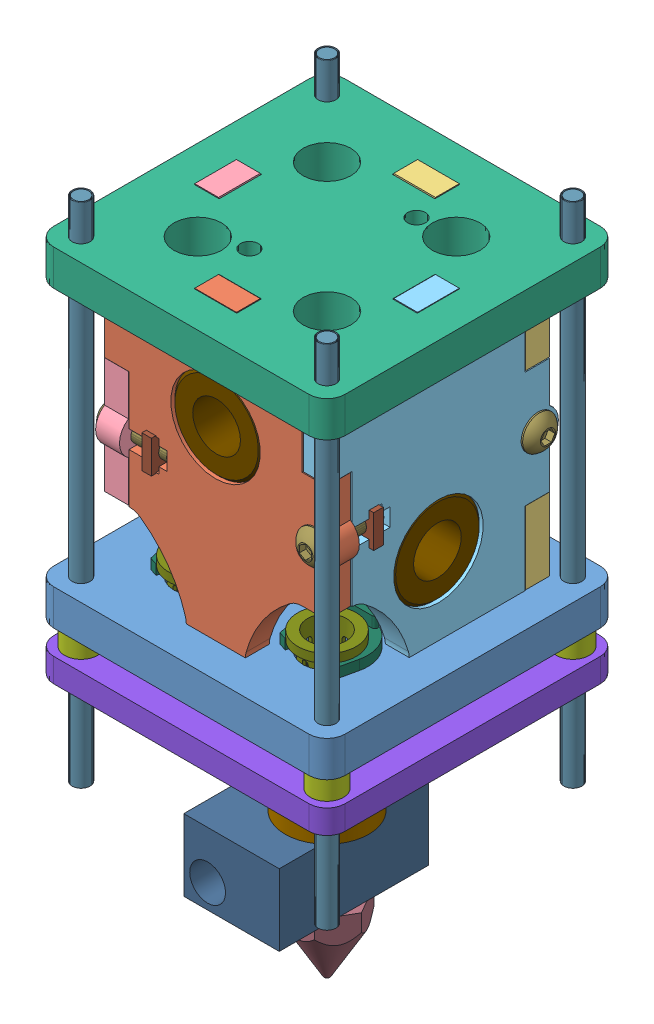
SolidWorks assembly UM_4000_ASM.sldasm, configuration Default (file format 5000). Lengths in mm.
Overall size (48.8 102.4 48.8).
34 component instances, 18 part files, 0 mates.
Components (placement in the parent):
- UM_4003-1: UM_4003.sldprt [Default] at origin size (48.8 6 48.8)
- UM_4005-1: UM_4005.sldprt [Default] at (0 25 16.675) x (1 0 0) z (0 -1 0) size (38.7 4 55.5)
- UM_4004-1: UM_4004.sldprt [Default] at (0 25 -16.675) x (-1 0 0) z (0 -1 0) size (38.7 4 55.5)
- UM_4006-1: UM_4006.sldprt [Default] at (-16.675 25 0) x (0 0 1) z (0 -1 0) size (38.7 4 55.5)
- UM_4007-1: UM_4007.sldprt [Default] at (16.675 25 0) x (0 0 -1) z (0 -1 0) size (38.7 4 55.5)
- UM_4002-1: UM_4002.sldprt [Default] at (0 49.3 0) size (48.8 6 48.8)
- UM_4008-1: UM_4008.sldprt [Default] at (20.6 -5.05 20.6) x (0 -1 0) z (0 0 1) size (4.1 5.5 5.5)
- UM_4001-1: UM_4001.sldprt [Default] at (0 -9.1 0) size (48.8 4 48.8)
- UM_4008-2: UM_4008.sldprt [Default] at (-20.6 -5.05 20.6) x (0 -1 0) z (0 0 1) size (4.1 5.5 5.5)
- UM_4008-3: UM_4008.sldprt [Default] at (-20.6 -5.05 -20.6) x (0 -1 0) z (0 0 1) size (4.1 5.5 5.5)
- UM_4008-4: UM_4008.sldprt [Default] at (20.6 -5.05 -20.6) x (0 -1 0) z (0 0 1) size (4.1 5.5 5.5)
- UM_4009-1: UM_4009.sldprt [Default] at (10.825 -11.5 10.825) x (0 1 0) z (0 0 1) size (17.2 16.5 16.5)
- UM_4013-1: UM_4013.sldprt [Default] at (7.325 -26.1 10.825) x (0 0 -1) z (1 0 0) size (25 12 16)
- DIN562_M3-1: DIN562_M3.sldprt [Default] at (16.675 25 10.8) x (1 0 0) z (0 -1 0) size (5.5 1.6 5.5)
- DIN562_M3-2: DIN562_M3.sldprt [Default] at (-10.8 25 16.675) x (0 0 1) z (0 -1 0) size (5.5 1.6 5.5)
- DIN562_M3-3: DIN562_M3.sldprt [Default] at (-16.675 25 -10.8) x (-1 0 0) z (0 -1 0) size (5.5 1.6 5.5)
- DIN562_M3-4: DIN562_M3.sldprt [Default] at (10.8 25 -16.675) x (0 0 -1) z (0 -1 0) size (5.5 1.6 5.5)
- ISO7380_M3X10-1: ISO7380_M3X10.sldprt [Default] at (18.675 25 -16.7) x (0 -1 0) z (0 0 1) size (5.77 11.9 5.75)
- ISO7380_M3X10-2: ISO7380_M3X10.sldprt [Default] at (16.7 25 18.675) x (-1 0 0) z (0 1 0) size (5.77 11.9 5.75)
- ISO7380_M3X10-3: ISO7380_M3X10.sldprt [Default] at (-18.675 25 16.7) x (0 1 0) z (0 0 1) size (5.77 11.9 5.75)
- ISO7380_M3X10-4: ISO7380_M3X10.sldprt [Default] at (-16.7 25 -18.675) x (1 0 0) z (0 1 0) size (5.77 11.9 5.75)
- UM_4012-1: UM_4012.sldprt [Default] at (10.825 -38.1 10.825) size (12.24 12 10)
- UM_4011-1: UM_4011.sldprt [Default] at (20.6 15.8 -20.6) x (0 -1 0) z (0 0 1) size (85 3 3)
- ISO7380_M3X10-5: ISO7380_M3X10.sldprt [Default] at (2.325 -23.1 -1.675) x (1 0 0) z (0 1 0) size (5.77 11.9 5.75)
- CONNECTION_HOLDER-1: CONNECTION_HOLDER.sldprt [Default] at (10.825 3.825 9.675) x (-1 0 0) z (0 0 -1) size (11.4 3.45 10.2)
- TUBE_CONNECTION-1: TUBE_CONNECTION.sldprt [Default] at (10.825 1.85 10.825) x (0 1 0) z (0 0 1) size (8.5 9.8 9.8)
- CONNECTION_HOLDER-2: CONNECTION_HOLDER.sldprt [Default] at (-10.825 3.825 9.675) x (-1 0 0) z (0 0 -1) size (11.4 3.45 10.2)
- TUBE_CONNECTION-2: TUBE_CONNECTION.sldprt [Default] at (-10.825 1.85 10.825) x (0 1 0) z (0 0 1) size (8.5 9.8 9.8)
- UM_4014-1: UM_4014.sldprt [Default] at (10.825 -24.1185 10.825) x (0 -1 0) z (0 0 1) size (30 6 6)
- UM_4011-2: UM_4011.sldprt [Default] at (20.6 15.8 20.6) x (0 -1 0) z (0 0 1) size (85 3 3)
- UM_4011-3: UM_4011.sldprt [Default] at (-20.6 15.8 20.6) x (0 -1 0) z (0 0 1) size (85 3 3)
- UM_4011-4: UM_4011.sldprt [Default] at (-20.6 15.8 -20.6) x (0 -1 0) z (0 0 1) size (85 3 3)
- LINEAR_BALL_BEARING_37X15X8-1: LINEAR_BALL_BEARING_37X15X8.sldprt [Default] at (0 16 0) size (37 15 15)
- LINEAR_BALL_BEARING_37X15X8-2: LINEAR_BALL_BEARING_37X15X8.sldprt [Default] at (0 34 0) x (0 0 1) z (0 1 0) size (37 15 15)
